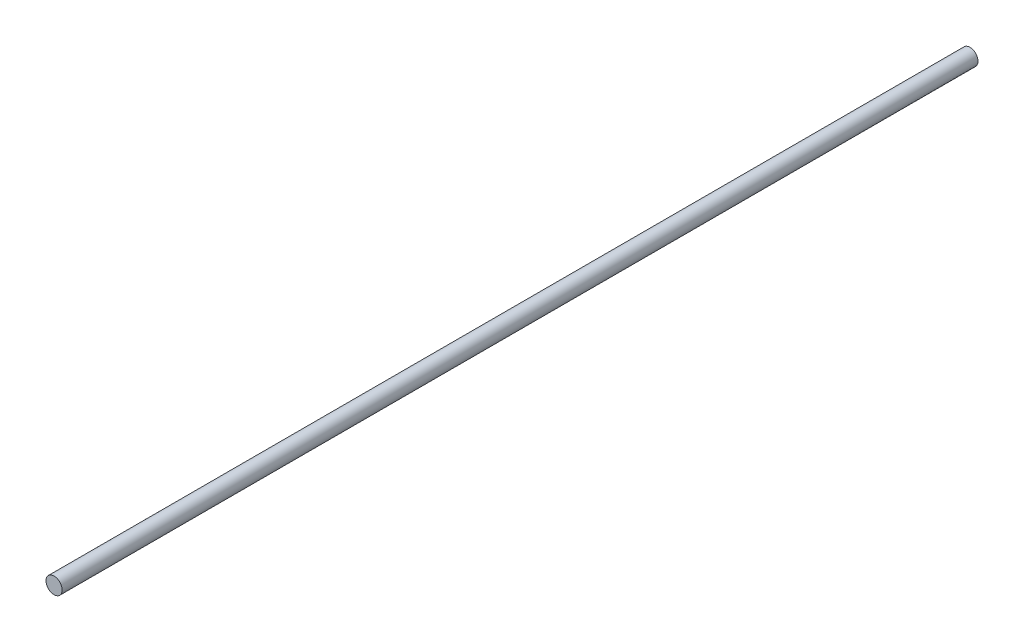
from build123d import *

# Parameters (mm, degrees)
SKETCH1_R           = 30
BOSS_EXTRUDE1_DEPTH = 3400


with BuildPart() as part:
    # Sketch1 → Boss-Extrude1 (new body)
    with BuildSketch(Plane.XY):
        Circle(SKETCH1_R)
    extrude(amount=-BOSS_EXTRUDE1_DEPTH)


solid = part.part
